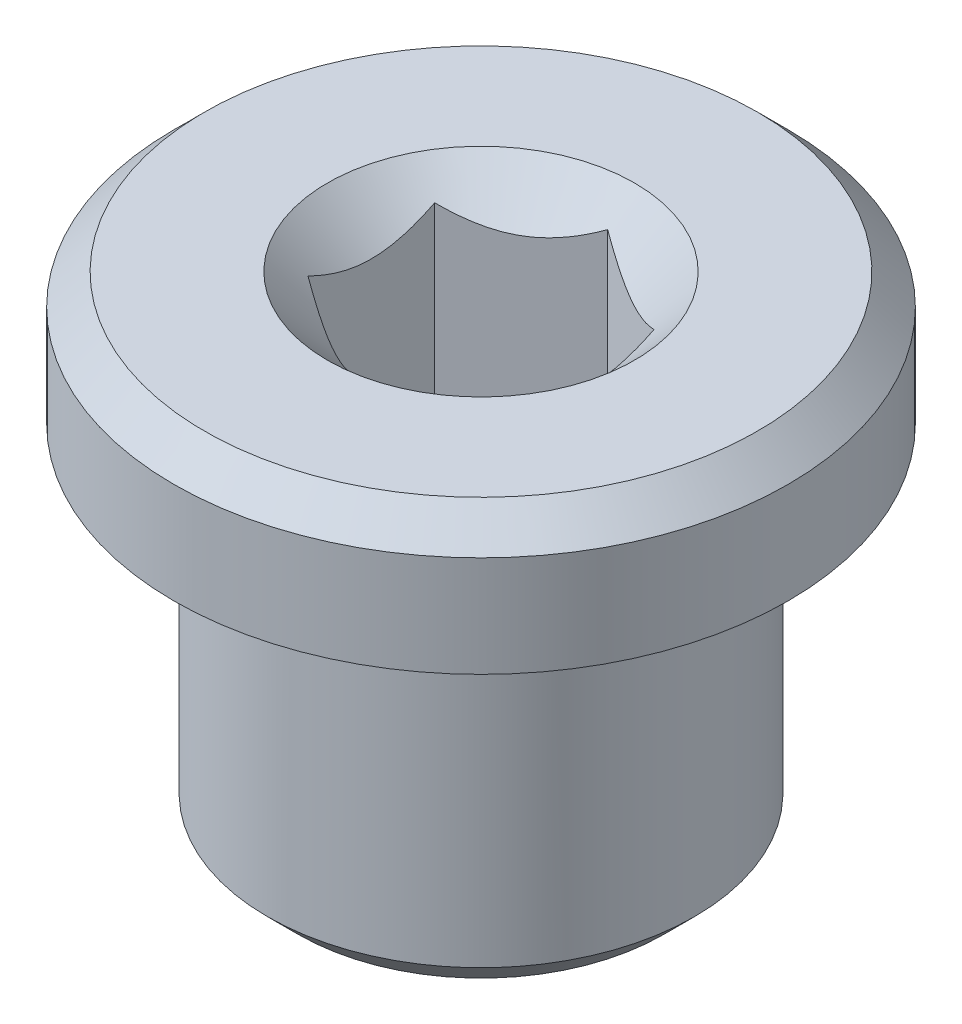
ISO-10303-21;
HEADER;
FILE_DESCRIPTION(('STEP AP214'),'2;1');
FILE_NAME('part.step','',(''),(''),'','','');
FILE_SCHEMA(('AUTOMOTIVE_DESIGN { 1 0 10303 214 1 1 1 1 }'));
ENDSEC;
DATA;
#1=APPLICATION_CONTEXT('core data for automotive mechanical design processes');
#2=APPLICATION_PROTOCOL_DEFINITION('international standard','automotive_design',2000,#1);
#3=PRODUCT_CONTEXT('',#1,'mechanical');
#4=PRODUCT('Part','Part','',(#3));
#5=PRODUCT_RELATED_PRODUCT_CATEGORY('part','',(#4));
#6=PRODUCT_DEFINITION_FORMATION('','',#4);
#7=PRODUCT_DEFINITION_CONTEXT('part definition',#1,'design');
#8=PRODUCT_DEFINITION('design','',#6,#7);
#9=PRODUCT_DEFINITION_SHAPE('','',#8);
#10=(LENGTH_UNIT() NAMED_UNIT(*) SI_UNIT(.MILLI.,.METRE.));
#11=(NAMED_UNIT(*) PLANE_ANGLE_UNIT() SI_UNIT($,.RADIAN.));
#12=(NAMED_UNIT(*) SI_UNIT($,.STERADIAN.) SOLID_ANGLE_UNIT());
#13=UNCERTAINTY_MEASURE_WITH_UNIT(LENGTH_MEASURE(1.E-05),#10,'distance_accuracy_value','');
#14=(GEOMETRIC_REPRESENTATION_CONTEXT(3) GLOBAL_UNCERTAINTY_ASSIGNED_CONTEXT((#13)) GLOBAL_UNIT_ASSIGNED_CONTEXT((#10,
#11,#12)) REPRESENTATION_CONTEXT('',''));
#15=CARTESIAN_POINT('',(0.,0.,0.));
#16=DIRECTION('',(0.,0.,1.));
#17=DIRECTION('',(1.,0.,0.));
#18=AXIS2_PLACEMENT_3D('',#15,#16,#17);
#19=CARTESIAN_POINT('',(0.,55.,-32.));
#20=DIRECTION('',(0.,1.,0.));
#21=DIRECTION('',(-1.,0.,0.));
#22=AXIS2_PLACEMENT_3D('',#19,#20,#21);
#23=PLANE('',#22);
#24=CARTESIAN_POINT('',(0.,55.0000000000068,-32.));
#25=DIRECTION('',(0.,1.,0.));
#26=DIRECTION('',(0.,0.,1.));
#27=AXIS2_PLACEMENT_3D('',#24,#25,#26);
#28=CIRCLE('',#27,3.50000000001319);
#29=CARTESIAN_POINT('',(0.,55.0000000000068,-28.4999999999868));
#30=VERTEX_POINT('',#29);
#31=EDGE_CURVE('E21',#30,#30,#28,.T.);
#32=ORIENTED_EDGE('',*,*,#31,.F.);
#33=EDGE_LOOP('',(#32));
#34=FACE_BOUND('',#33,.T.);
#35=CARTESIAN_POINT('',(0.,55.0000000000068,-32.));
#36=DIRECTION('',(0.,-1.,0.));
#37=DIRECTION('',(0.,0.,-1.));
#38=AXIS2_PLACEMENT_3D('',#35,#36,#37);
#39=CIRCLE('',#38,6.30000000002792);
#40=CARTESIAN_POINT('',(0.,55.0000000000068,-38.3000000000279));
#41=VERTEX_POINT('',#40);
#42=EDGE_CURVE('E189',#41,#41,#39,.T.);
#43=ORIENTED_EDGE('',*,*,#42,.F.);
#44=EDGE_LOOP('',(#43));
#45=FACE_BOUND('',#44,.T.);
#46=ADVANCED_FACE('F16',(#34,#45),#23,.T.);
#47=CARTESIAN_POINT('',(0.,54.300000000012,-32.));
#48=DIRECTION('',(0.,-1.,0.));
#49=DIRECTION('',(0.,0.,-1.));
#50=AXIS2_PLACEMENT_3D('',#47,#48,#49);
#51=CONICAL_SURFACE('',#50,6.99999999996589,0.785398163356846);
#52=ORIENTED_EDGE('',*,*,#42,.T.);
#53=EDGE_LOOP('',(#52));
#54=FACE_BOUND('',#53,.T.);
#55=CARTESIAN_POINT('',(0.,54.3,-32.));
#56=DIRECTION('',(0.,1.,0.));
#57=DIRECTION('',(-1.,0.,0.));
#58=AXIS2_PLACEMENT_3D('',#55,#56,#57);
#59=CIRCLE('',#58,7.);
#60=CARTESIAN_POINT('',(-7.,54.3,-32.));
#61=VERTEX_POINT('',#60);
#62=EDGE_CURVE('E184',#61,#61,#59,.F.);
#63=ORIENTED_EDGE('',*,*,#62,.F.);
#64=EDGE_LOOP('',(#63));
#65=FACE_BOUND('',#64,.T.);
#66=ADVANCED_FACE('F193',(#54,#65),#51,.T.);
#67=CARTESIAN_POINT('',(0.,55.,-32.));
#68=DIRECTION('',(0.,1.,0.));
#69=DIRECTION('',(-1.,0.,0.));
#70=AXIS2_PLACEMENT_3D('',#67,#68,#69);
#71=CYLINDRICAL_SURFACE('',#70,7.);
#72=CARTESIAN_POINT('',(0.,52.,-32.));
#73=DIRECTION('',(0.,1.,0.));
#74=DIRECTION('',(-1.,0.,0.));
#75=AXIS2_PLACEMENT_3D('',#72,#73,#74);
#76=CIRCLE('',#75,7.);
#77=CARTESIAN_POINT('',(-7.,52.,-32.));
#78=VERTEX_POINT('',#77);
#79=EDGE_CURVE('E181',#78,#78,#76,.T.);
#80=ORIENTED_EDGE('',*,*,#79,.T.);
#81=EDGE_LOOP('',(#80));
#82=FACE_BOUND('',#81,.T.);
#83=ORIENTED_EDGE('',*,*,#62,.T.);
#84=EDGE_LOOP('',(#83));
#85=FACE_BOUND('',#84,.T.);
#86=ADVANCED_FACE('F202',(#82,#85),#71,.T.);
#87=CARTESIAN_POINT('',(0.,52.,-32.));
#88=DIRECTION('',(0.,1.,0.));
#89=DIRECTION('',(-1.,0.,0.));
#90=AXIS2_PLACEMENT_3D('',#87,#88,#89);
#91=PLANE('',#90);
#92=CARTESIAN_POINT('',(0.,52.,-32.));
#93=DIRECTION('',(0.,-1.,0.));
#94=DIRECTION('',(1.,0.,0.));
#95=AXIS2_PLACEMENT_3D('',#92,#93,#94);
#96=CIRCLE('',#95,4.865);
#97=CARTESIAN_POINT('',(4.865,52.,-32.));
#98=VERTEX_POINT('',#97);
#99=EDGE_CURVE('E178',#98,#98,#96,.T.);
#100=ORIENTED_EDGE('',*,*,#99,.F.);
#101=EDGE_LOOP('',(#100));
#102=FACE_BOUND('',#101,.T.);
#103=ORIENTED_EDGE('',*,*,#79,.F.);
#104=EDGE_LOOP('',(#103));
#105=FACE_BOUND('',#104,.T.);
#106=ADVANCED_FACE('F207',(#102,#105),#91,.F.);
#107=CARTESIAN_POINT('',(0.,44.,-32.));
#108=DIRECTION('',(0.,1.,0.));
#109=DIRECTION('',(-1.,0.,0.));
#110=AXIS2_PLACEMENT_3D('',#107,#108,#109);
#111=PLANE('',#110);
#112=CARTESIAN_POINT('',(0.,43.9999999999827,-32.));
#113=DIRECTION('',(0.,1.,0.));
#114=DIRECTION('',(0.,0.,1.));
#115=AXIS2_PLACEMENT_3D('',#112,#113,#114);
#116=CIRCLE('',#115,4.16499999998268);
#117=CARTESIAN_POINT('',(0.,43.9999999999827,-27.8350000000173));
#118=VERTEX_POINT('',#117);
#119=EDGE_CURVE('E175',#118,#118,#116,.T.);
#120=ORIENTED_EDGE('',*,*,#119,.F.);
#121=EDGE_LOOP('',(#120));
#122=FACE_BOUND('',#121,.T.);
#123=ADVANCED_FACE('F211',(#122),#111,.F.);
#124=CARTESIAN_POINT('',(0.,44.6999999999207,-32.));
#125=DIRECTION('',(0.,1.,0.));
#126=DIRECTION('',(0.,0.,1.));
#127=AXIS2_PLACEMENT_3D('',#124,#125,#126);
#128=CONICAL_SURFACE('',#127,4.86499999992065,0.785398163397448);
#129=CARTESIAN_POINT('',(0.,44.7,-32.));
#130=DIRECTION('',(0.,-1.,0.));
#131=DIRECTION('',(1.,0.,0.));
#132=AXIS2_PLACEMENT_3D('',#129,#130,#131);
#133=CIRCLE('',#132,4.865);
#134=CARTESIAN_POINT('',(4.865,44.7,-32.));
#135=VERTEX_POINT('',#134);
#136=EDGE_CURVE('E170',#135,#135,#133,.F.);
#137=ORIENTED_EDGE('',*,*,#136,.F.);
#138=EDGE_LOOP('',(#137));
#139=FACE_BOUND('',#138,.T.);
#140=ORIENTED_EDGE('',*,*,#119,.T.);
#141=EDGE_LOOP('',(#140));
#142=FACE_BOUND('',#141,.T.);
#143=ADVANCED_FACE('F215',(#139,#142),#128,.T.);
#144=CARTESIAN_POINT('',(0.,44.,-32.));
#145=DIRECTION('',(0.,-1.,0.));
#146=DIRECTION('',(1.,0.,0.));
#147=AXIS2_PLACEMENT_3D('',#144,#145,#146);
#148=CYLINDRICAL_SURFACE('',#147,4.865);
#149=ORIENTED_EDGE('',*,*,#136,.T.);
#150=EDGE_LOOP('',(#149));
#151=FACE_BOUND('',#150,.T.);
#152=ORIENTED_EDGE('',*,*,#99,.T.);
#153=EDGE_LOOP('',(#152));
#154=FACE_BOUND('',#153,.T.);
#155=ADVANCED_FACE('F218',(#151,#154),#148,.T.);
#156=CARTESIAN_POINT('',(-2.5,50.,-30.5566243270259));
#157=DIRECTION('',(-0.5,0.,0.866025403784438));
#158=DIRECTION('',(0.866025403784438,0.,0.5));
#159=AXIS2_PLACEMENT_3D('',#156,#157,#158);
#160=PLANE('',#159);
#161=DIRECTION('',(0.,1.,0.));
#162=VECTOR('',#161,1.);
#163=CARTESIAN_POINT('',(0.,50.,-29.1132486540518));
#164=LINE('',#163,#162);
#165=CARTESIAN_POINT('',(0.,50.,-29.1132486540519));
#166=VERTEX_POINT('',#165);
#167=CARTESIAN_POINT('',(2.93779550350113E-09,54.3867513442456,-29.113248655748));
#168=VERTEX_POINT('',#167);
#169=EDGE_CURVE('E168',#166,#168,#164,.T.);
#170=ORIENTED_EDGE('',*,*,#169,.F.);
#171=DIRECTION('',(0.866025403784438,0.,0.5));
#172=VECTOR('',#171,1.);
#173=CARTESIAN_POINT('',(-2.5,50.,-30.5566243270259));
#174=LINE('',#173,#172);
#175=CARTESIAN_POINT('',(-2.5,50.,-30.5566243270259));
#176=VERTEX_POINT('',#175);
#177=EDGE_CURVE('E164',#176,#166,#174,.T.);
#178=ORIENTED_EDGE('',*,*,#177,.F.);
#179=DIRECTION('',(0.,1.,0.));
#180=VECTOR('',#179,1.);
#181=CARTESIAN_POINT('',(-2.5,50.,-30.5566243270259));
#182=LINE('',#181,#180);
#183=CARTESIAN_POINT('',(-2.50000002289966,54.3867513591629,-30.556624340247));
#184=VERTEX_POINT('',#183);
#185=EDGE_CURVE('E163',#184,#176,#182,.F.);
#186=ORIENTED_EDGE('',*,*,#185,.F.);
#187=CARTESIAN_POINT('',(-2.50000004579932,54.386751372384,-30.5566243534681));
#188=CARTESIAN_POINT('',(-2.41407382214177,54.3371894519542,-30.507014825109));
#189=CARTESIAN_POINT('',(-2.32671091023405,54.2905388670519,-30.4565758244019));
#190=CARTESIAN_POINT('',(-2.14856896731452,54.2051236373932,-30.3537255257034));
#191=CARTESIAN_POINT('',(-2.05777300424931,54.1664065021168,-30.3013044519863));
#192=CARTESIAN_POINT('',(-1.87468739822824,54.1000837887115,-30.1955999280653));
#193=CARTESIAN_POINT('',(-1.7824443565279,54.0723115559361,-30.1423433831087));
#194=CARTESIAN_POINT('',(-1.59592810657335,54.0295231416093,-30.0346581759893));
#195=CARTESIAN_POINT('',(-1.50166059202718,54.0144750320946,-29.9802328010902));
#196=CARTESIAN_POINT('',(-1.33918619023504,54.0008973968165,-29.8864281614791));
#197=CARTESIAN_POINT('',(-1.27118905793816,53.9988880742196,-29.8471699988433));
#198=CARTESIAN_POINT('',(-1.13530604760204,54.00227754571,-29.7687179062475));
#199=CARTESIAN_POINT('',(-1.067420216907,54.0076789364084,-29.7295240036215));
#200=CARTESIAN_POINT('',(-0.932289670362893,54.0255824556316,-29.6515063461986));
#201=CARTESIAN_POINT('',(-0.865045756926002,54.0380925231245,-29.6126830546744));
#202=CARTESIAN_POINT('',(-0.731720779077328,54.069526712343,-29.5357078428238));
#203=CARTESIAN_POINT('',(-0.665639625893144,54.0884503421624,-29.4975558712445));
#204=CARTESIAN_POINT('',(-0.496416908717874,54.144615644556,-29.3998550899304));
#205=CARTESIAN_POINT('',(-0.394323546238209,54.1860863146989,-29.3409114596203));
#206=CARTESIAN_POINT('',(-0.244203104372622,54.2560924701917,-29.2542393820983));
#207=CARTESIAN_POINT('',(-0.194731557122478,54.2806890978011,-29.2256769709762));
#208=CARTESIAN_POINT('',(-0.0967044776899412,54.3321241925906,-29.169081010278));
#209=CARTESIAN_POINT('',(-0.04814840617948,54.3589612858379,-29.1410471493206));
#210=CARTESIAN_POINT('',(-8.92368186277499E-09,54.3867513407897,-29.1132486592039));
#211=B_SPLINE_CURVE_WITH_KNOTS('',3,(#187,#188,#189,#190,#191,#192,#193,#194,#195,#196,#197,
#198,#199,#200,#201,#202,#203,#204,#205,#206,#207,#208,#209,#210),.UNSPECIFIED.,.F.,.F.,(4,2,2,
2,2,2,2,2,2,2,2,4),(0.,0.332957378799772,0.667853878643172,0.997433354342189,1.32618335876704,
1.56147595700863,1.79685101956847,2.03248946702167,2.26810984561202,2.64223187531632,
2.8287854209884,3.01522539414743),.UNSPECIFIED.);
#212=EDGE_CURVE('E39',#184,#168,#211,.T.);
#213=ORIENTED_EDGE('',*,*,#212,.T.);
#214=EDGE_LOOP('',(#170,#178,#186,#213));
#215=FACE_BOUND('',#214,.T.);
#216=ADVANCED_FACE('F152',(#215),#160,.F.);
#217=CARTESIAN_POINT('',(-2.5,50.,-33.4433756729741));
#218=DIRECTION('',(-1.,0.,0.));
#219=DIRECTION('',(0.,0.,1.));
#220=AXIS2_PLACEMENT_3D('',#217,#218,#219);
#221=PLANE('',#220);
#222=ORIENTED_EDGE('',*,*,#185,.T.);
#223=DIRECTION('',(0.,0.,1.));
#224=VECTOR('',#223,1.);
#225=CARTESIAN_POINT('',(-2.5,50.,-33.4433756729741));
#226=LINE('',#225,#224);
#227=CARTESIAN_POINT('',(-2.49999999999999,50.,-33.4433756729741));
#228=VERTEX_POINT('',#227);
#229=EDGE_CURVE('E124',#228,#176,#226,.T.);
#230=ORIENTED_EDGE('',*,*,#229,.F.);
#231=DIRECTION('',(0.,1.,0.));
#232=VECTOR('',#231,1.);
#233=CARTESIAN_POINT('',(-2.5,50.,-33.4433756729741));
#234=LINE('',#233,#232);
#235=CARTESIAN_POINT('',(-2.5,54.3867513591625,-33.4433756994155));
#236=VERTEX_POINT('',#235);
#237=EDGE_CURVE('E129',#236,#228,#234,.F.);
#238=ORIENTED_EDGE('',*,*,#237,.F.);
#239=CARTESIAN_POINT('',(-2.5,54.3867513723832,-33.4433757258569));
#240=CARTESIAN_POINT('',(-2.5,54.3371894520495,-33.3441566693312));
#241=CARTESIAN_POINT('',(-2.5,54.2905388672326,-33.2432786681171));
#242=CARTESIAN_POINT('',(-2.5,54.2051236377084,-33.0375780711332));
#243=CARTESIAN_POINT('',(-2.5,54.1664065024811,-32.9327359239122));
#244=CARTESIAN_POINT('',(-2.5,54.100083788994,-32.7213268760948));
#245=CARTESIAN_POINT('',(-2.5,54.0723115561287,-32.6148137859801));
#246=CARTESIAN_POINT('',(-2.5,54.0295231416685,-32.3994433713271));
#247=CARTESIAN_POINT('',(-2.5,54.0144750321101,-32.2905926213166));
#248=CARTESIAN_POINT('',(-2.5,54.0008973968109,-32.1029833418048));
#249=CARTESIAN_POINT('',(-2.5,53.9988880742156,-32.0244670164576));
#250=CARTESIAN_POINT('',(-2.5,54.0022775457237,-31.867562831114));
#251=CARTESIAN_POINT('',(-2.5,54.0076789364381,-31.7891750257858));
#252=CARTESIAN_POINT('',(-2.5,54.0255824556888,-31.6331397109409));
#253=CARTESIAN_POINT('',(-2.5,54.0380925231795,-31.5554931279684));
#254=CARTESIAN_POINT('',(-2.5,54.0695267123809,-31.4015427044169));
#255=CARTESIAN_POINT('',(-2.5,54.088450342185,-31.3252387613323));
#256=CARTESIAN_POINT('',(-2.5,54.1446156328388,-31.1298372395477));
#257=CARTESIAN_POINT('',(-2.5,54.1860862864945,-31.0119500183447));
#258=CARTESIAN_POINT('',(-2.5,54.2560924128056,-30.8386059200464));
#259=CARTESIAN_POINT('',(-2.5,54.2806890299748,-30.7814811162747));
#260=CARTESIAN_POINT('',(-2.5,54.3321241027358,-30.6682892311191));
#261=CARTESIAN_POINT('',(-2.5,54.3589611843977,-30.6122215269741));
#262=CARTESIAN_POINT('',(-2.5,54.3867512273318,-30.5566245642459));
#263=B_SPLINE_CURVE_WITH_KNOTS('',3,(#239,#240,#241,#242,#243,#244,#245,#246,#247,#248,#249,
#250,#251,#252,#253,#254,#255,#256,#257,#258,#259,#260,#261,#262),.UNSPECIFIED.,.F.,.F.,(4,2,2,
2,2,2,2,2,2,2,2,4),(0.,0.332957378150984,0.66785387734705,0.997433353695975,1.32618335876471,
1.56147595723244,1.79685102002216,2.03248946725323,2.26810984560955,2.64223174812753,
2.82878523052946,3.01522514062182),.UNSPECIFIED.);
#264=EDGE_CURVE('E10',#236,#184,#263,.T.);
#265=ORIENTED_EDGE('',*,*,#264,.T.);
#266=EDGE_LOOP('',(#222,#230,#238,#265));
#267=FACE_BOUND('',#266,.T.);
#268=ADVANCED_FACE('F147',(#267),#221,.F.);
#269=CARTESIAN_POINT('',(0.,50.,-34.8867513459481));
#270=DIRECTION('',(-0.5,0.,-0.866025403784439));
#271=DIRECTION('',(-0.866025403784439,0.,0.5));
#272=AXIS2_PLACEMENT_3D('',#269,#270,#271);
#273=PLANE('',#272);
#274=ORIENTED_EDGE('',*,*,#237,.T.);
#275=DIRECTION('',(-0.866025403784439,0.,0.5));
#276=VECTOR('',#275,1.);
#277=CARTESIAN_POINT('',(0.,50.,-34.8867513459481));
#278=LINE('',#277,#276);
#279=CARTESIAN_POINT('',(0.,50.,-34.8867513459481));
#280=VERTEX_POINT('',#279);
#281=EDGE_CURVE('E120',#280,#228,#278,.T.);
#282=ORIENTED_EDGE('',*,*,#281,.F.);
#283=DIRECTION('',(0.,1.,0.));
#284=VECTOR('',#283,1.);
#285=CARTESIAN_POINT('',(0.,50.,-34.8867513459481));
#286=LINE('',#285,#284);
#287=CARTESIAN_POINT('',(2.28991515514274E-08,54.3867513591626,-34.8867513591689));
#288=VERTEX_POINT('',#287);
#289=EDGE_CURVE('E128',#288,#280,#286,.F.);
#290=ORIENTED_EDGE('',*,*,#289,.F.);
#291=CARTESIAN_POINT('',(4.5798304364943E-08,54.3867513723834,-34.8867513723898));
#292=CARTESIAN_POINT('',(-0.0859261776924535,54.3371894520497,-34.8371418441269));
#293=CARTESIAN_POINT('',(-0.173289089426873,54.2905388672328,-34.7867028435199));
#294=CARTESIAN_POINT('',(-0.351431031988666,54.2051236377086,-34.6838525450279));
#295=CARTESIAN_POINT('',(-0.442226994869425,54.1664065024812,-34.6314314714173));
#296=CARTESIAN_POINT('',(-0.625312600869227,54.100083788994,-34.5257269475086));
#297=CARTESIAN_POINT('',(-0.717555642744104,54.0723115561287,-34.4724704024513));
#298=CARTESIAN_POINT('',(-0.904071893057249,54.0295231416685,-34.3647851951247));
#299=CARTESIAN_POINT('',(-0.998339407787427,54.0144750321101,-34.3103598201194));
#300=CARTESIAN_POINT('',(-1.16081380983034,54.0008973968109,-34.2165551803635));
#301=CARTESIAN_POINT('',(-1.22881094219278,53.9988880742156,-34.1772970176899));
#302=CARTESIAN_POINT('',(-1.36469395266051,54.0022775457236,-34.0988449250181));
#303=CARTESIAN_POINT('',(-1.4325797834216,54.0076789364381,-34.059651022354));
#304=CARTESIAN_POINT('',(-1.56771032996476,54.0255824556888,-33.9816333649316));
#305=CARTESIAN_POINT('',(-1.63495424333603,54.0380925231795,-33.9428100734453));
#306=CARTESIAN_POINT('',(-1.76827922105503,54.0695267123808,-33.8658348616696));
#307=CARTESIAN_POINT('',(-1.83436037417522,54.0884503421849,-33.8276828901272));
#308=CARTESIAN_POINT('',(-2.00358305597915,54.1446156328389,-33.7299821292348));
#309=CARTESIAN_POINT('',(-2.10567638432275,54.1860862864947,-33.6710385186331));
#310=CARTESIAN_POINT('',(-2.25579677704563,54.256092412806,-33.5843664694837));
#311=CARTESIAN_POINT('',(-2.30526830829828,54.2806890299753,-33.5558040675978));
#312=CARTESIAN_POINT('',(-2.40329535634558,54.3321241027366,-33.4992081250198));
#313=CARTESIAN_POINT('',(-2.45185141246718,54.3589611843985,-33.4711742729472));
#314=CARTESIAN_POINT('',(-2.49999979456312,54.3867512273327,-33.4433757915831));
#315=B_SPLINE_CURVE_WITH_KNOTS('',3,(#291,#292,#293,#294,#295,#296,#297,#298,#299,#300,#301,
#302,#303,#304,#305,#306,#307,#308,#309,#310,#311,#312,#313,#314),.UNSPECIFIED.,.F.,.F.,(4,2,2,
2,2,2,2,2,2,2,2,4),(0.,0.332957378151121,0.667853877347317,0.997433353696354,1.32618335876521,
1.56147595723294,1.79685102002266,2.03248946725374,2.26810984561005,2.64223174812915,
2.82878523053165,3.01522514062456),.UNSPECIFIED.);
#316=EDGE_CURVE('E26',#288,#236,#315,.T.);
#317=ORIENTED_EDGE('',*,*,#316,.T.);
#318=EDGE_LOOP('',(#274,#282,#290,#317));
#319=FACE_BOUND('',#318,.T.);
#320=ADVANCED_FACE('F151',(#319),#273,.F.);
#321=CARTESIAN_POINT('',(2.49999999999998,50.,-33.4433756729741));
#322=DIRECTION('',(0.5,0.,-0.866025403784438));
#323=DIRECTION('',(-0.866025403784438,0.,-0.5));
#324=AXIS2_PLACEMENT_3D('',#321,#322,#323);
#325=PLANE('',#324);
#326=ORIENTED_EDGE('',*,*,#289,.T.);
#327=DIRECTION('',(-0.866025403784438,0.,-0.5));
#328=VECTOR('',#327,1.);
#329=CARTESIAN_POINT('',(2.49999999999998,50.,-33.4433756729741));
#330=LINE('',#329,#328);
#331=CARTESIAN_POINT('',(2.5,50.,-33.4433756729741));
#332=VERTEX_POINT('',#331);
#333=EDGE_CURVE('E82',#332,#280,#330,.T.);
#334=ORIENTED_EDGE('',*,*,#333,.F.);
#335=DIRECTION('',(0.,1.,0.));
#336=VECTOR('',#335,1.);
#337=CARTESIAN_POINT('',(2.49999999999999,50.,-33.4433756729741));
#338=LINE('',#337,#336);
#339=CARTESIAN_POINT('',(2.50000002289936,54.3867513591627,-33.4433756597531));
#340=VERTEX_POINT('',#339);
#341=EDGE_CURVE('E79',#340,#332,#338,.F.);
#342=ORIENTED_EDGE('',*,*,#341,.F.);
#343=CARTESIAN_POINT('',(2.50000004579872,54.3867513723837,-33.4433756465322));
#344=CARTESIAN_POINT('',(2.41407382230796,54.33718945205,-33.492985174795));
#345=CARTESIAN_POINT('',(2.32671091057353,54.290538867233,-33.5434241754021));
#346=CARTESIAN_POINT('',(2.14856896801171,54.2051236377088,-33.6462744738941));
#347=CARTESIAN_POINT('',(2.05777300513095,54.1664065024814,-33.6986955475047));
#348=CARTESIAN_POINT('',(1.87468739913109,54.1000837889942,-33.8044000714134));
#349=CARTESIAN_POINT('',(1.78244435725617,54.0723115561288,-33.8576566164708));
#350=CARTESIAN_POINT('',(1.59592810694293,54.0295231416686,-33.9653418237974));
#351=CARTESIAN_POINT('',(1.5016605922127,54.0144750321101,-34.0197671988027));
#352=CARTESIAN_POINT('',(1.33918619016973,54.0008973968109,-34.1135718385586));
#353=CARTESIAN_POINT('',(1.27118905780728,53.9988880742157,-34.1528300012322));
#354=CARTESIAN_POINT('',(1.13530604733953,54.0022775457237,-34.2312820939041));
#355=CARTESIAN_POINT('',(1.06742021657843,54.0076789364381,-34.2704759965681));
#356=CARTESIAN_POINT('',(0.932289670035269,54.0255824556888,-34.3484936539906));
#357=CARTESIAN_POINT('',(0.865045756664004,54.0380925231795,-34.3873169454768));
#358=CARTESIAN_POINT('',(0.731720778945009,54.0695267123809,-34.4642921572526));
#359=CARTESIAN_POINT('',(0.665639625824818,54.088450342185,-34.5024441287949));
#360=CARTESIAN_POINT('',(0.496416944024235,54.1446156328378,-34.6001448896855));
#361=CARTESIAN_POINT('',(0.394323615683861,54.1860862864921,-34.6590885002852));
#362=CARTESIAN_POINT('',(0.244203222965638,54.2560924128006,-34.745760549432));
#363=CARTESIAN_POINT('',(0.194731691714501,54.2806890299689,-34.774322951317));
#364=CARTESIAN_POINT('',(0.096704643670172,54.3321241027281,-34.8309188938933));
#365=CARTESIAN_POINT('',(0.0481485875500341,54.358961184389,-34.858952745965));
#366=CARTESIAN_POINT('',(2.05455523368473E-07,54.386751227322,-34.8867512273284));
#367=B_SPLINE_CURVE_WITH_KNOTS('',3,(#343,#344,#345,#346,#347,#348,#349,#350,#351,#352,#353,
#354,#355,#356,#357,#358,#359,#360,#361,#362,#363,#364,#365,#366),.UNSPECIFIED.,.F.,.F.,(4,2,2,
2,2,2,2,2,2,2,2,4),(0.,0.332957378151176,0.667853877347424,0.997433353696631,1.32618335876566,
1.56147595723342,1.79685102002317,2.03248946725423,2.26810984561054,2.6422317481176,
2.8287852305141,3.01522514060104),.UNSPECIFIED.);
#368=EDGE_CURVE('E70',#340,#288,#367,.T.);
#369=ORIENTED_EDGE('',*,*,#368,.T.);
#370=EDGE_LOOP('',(#326,#334,#342,#369));
#371=FACE_BOUND('',#370,.T.);
#372=ADVANCED_FACE('F80',(#371),#325,.F.);
#373=CARTESIAN_POINT('',(2.5,50.,-30.5566243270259));
#374=DIRECTION('',(1.,0.,0.));
#375=DIRECTION('',(0.,0.,-1.));
#376=AXIS2_PLACEMENT_3D('',#373,#374,#375);
#377=PLANE('',#376);
#378=ORIENTED_EDGE('',*,*,#341,.T.);
#379=DIRECTION('',(0.,0.,-1.));
#380=VECTOR('',#379,1.);
#381=CARTESIAN_POINT('',(2.5,50.,-30.5566243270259));
#382=LINE('',#381,#380);
#383=CARTESIAN_POINT('',(2.49999999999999,50.,-30.5566243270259));
#384=VERTEX_POINT('',#383);
#385=EDGE_CURVE('E60',#384,#332,#382,.T.);
#386=ORIENTED_EDGE('',*,*,#385,.F.);
#387=DIRECTION('',(0.,1.,0.));
#388=VECTOR('',#387,1.);
#389=CARTESIAN_POINT('',(2.5,50.,-30.5566243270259));
#390=LINE('',#389,#388);
#391=CARTESIAN_POINT('',(2.5,54.3867513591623,-30.5566243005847));
#392=VERTEX_POINT('',#391);
#393=EDGE_CURVE('E85',#392,#384,#390,.F.);
#394=ORIENTED_EDGE('',*,*,#393,.F.);
#395=CARTESIAN_POINT('',(2.5,54.3867513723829,-30.5566242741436));
#396=CARTESIAN_POINT('',(2.5,54.3371894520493,-30.6558433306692));
#397=CARTESIAN_POINT('',(2.5,54.2905388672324,-30.7567213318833));
#398=CARTESIAN_POINT('',(2.5,54.2051236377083,-30.9624219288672));
#399=CARTESIAN_POINT('',(2.5,54.166406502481,-31.0672640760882));
#400=CARTESIAN_POINT('',(2.5,54.1000837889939,-31.2786731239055));
#401=CARTESIAN_POINT('',(2.5,54.0723115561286,-31.3851862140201));
#402=CARTESIAN_POINT('',(2.5,54.0295231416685,-31.600556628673));
#403=CARTESIAN_POINT('',(2.5,54.0144750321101,-31.7094073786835));
#404=CARTESIAN_POINT('',(2.5,54.0008973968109,-31.8970166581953));
#405=CARTESIAN_POINT('',(2.5,53.9988880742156,-31.9755329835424));
#406=CARTESIAN_POINT('',(2.5,54.0022775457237,-32.1324371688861));
#407=CARTESIAN_POINT('',(2.5,54.0076789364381,-32.2108249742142));
#408=CARTESIAN_POINT('',(2.5,54.0255824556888,-32.3668602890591));
#409=CARTESIAN_POINT('',(2.5,54.0380925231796,-32.4445068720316));
#410=CARTESIAN_POINT('',(2.5,54.0695267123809,-32.5984572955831));
#411=CARTESIAN_POINT('',(2.5,54.088450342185,-32.6747612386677));
#412=CARTESIAN_POINT('',(2.5,54.1446156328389,-32.8701627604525));
#413=CARTESIAN_POINT('',(2.5,54.1860862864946,-32.9880499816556));
#414=CARTESIAN_POINT('',(2.5,54.2560924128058,-33.1613940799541));
#415=CARTESIAN_POINT('',(2.5,54.280689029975,-33.2185188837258));
#416=CARTESIAN_POINT('',(2.5,54.3321241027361,-33.3317107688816));
#417=CARTESIAN_POINT('',(2.5,54.358961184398,-33.3877784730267));
#418=CARTESIAN_POINT('',(2.5,54.3867512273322,-33.4433754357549));
#419=B_SPLINE_CURVE_WITH_KNOTS('',3,(#395,#396,#397,#398,#399,#400,#401,#402,#403,#404,#405,
#406,#407,#408,#409,#410,#411,#412,#413,#414,#415,#416,#417,#418),.UNSPECIFIED.,.F.,.F.,(4,2,2,
2,2,2,2,2,2,2,2,4),(0.,0.332957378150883,0.66785387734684,0.997433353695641,1.32618335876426,
1.56147595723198,1.79685102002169,2.03248946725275,2.26810984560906,2.64223174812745,
2.8287852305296,3.01522514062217),.UNSPECIFIED.);
#420=EDGE_CURVE('E73',#392,#340,#419,.T.);
#421=ORIENTED_EDGE('',*,*,#420,.T.);
#422=EDGE_LOOP('',(#378,#386,#394,#421));
#423=FACE_BOUND('',#422,.T.);
#424=ADVANCED_FACE('F84',(#423),#377,.F.);
#425=CARTESIAN_POINT('',(0.,50.,-29.1132486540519));
#426=DIRECTION('',(0.5,0.,0.866025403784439));
#427=DIRECTION('',(0.866025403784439,0.,-0.5));
#428=AXIS2_PLACEMENT_3D('',#425,#426,#427);
#429=PLANE('',#428);
#430=ORIENTED_EDGE('',*,*,#393,.T.);
#431=DIRECTION('',(0.866025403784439,0.,-0.5));
#432=VECTOR('',#431,1.);
#433=CARTESIAN_POINT('',(0.,50.,-29.1132486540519));
#434=LINE('',#433,#432);
#435=EDGE_CURVE('E138',#166,#384,#434,.T.);
#436=ORIENTED_EDGE('',*,*,#435,.F.);
#437=ORIENTED_EDGE('',*,*,#169,.T.);
#438=CARTESIAN_POINT('',(5.0119463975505E-09,54.3867513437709,-29.1132486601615));
#439=CARTESIAN_POINT('',(0.0859262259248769,54.3371894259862,-29.1628581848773));
#440=CARTESIAN_POINT('',(0.173289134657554,54.2905388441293,-29.2132971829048));
#441=CARTESIAN_POINT('',(0.351431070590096,54.2051236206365,-29.3161474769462));
#442=CARTESIAN_POINT('',(0.44222702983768,54.1664064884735,-29.3685685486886));
#443=CARTESIAN_POINT('',(0.62531262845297,54.1000837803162,-29.4742730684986));
#444=CARTESIAN_POINT('',(0.717555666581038,54.0723115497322,-29.5275296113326));
#445=CARTESIAN_POINT('',(0.904071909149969,54.0295231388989,-29.6352148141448));
#446=CARTESIAN_POINT('',(0.998339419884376,54.0144750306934,-29.6896401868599));
#447=CARTESIAN_POINT('',(1.16081381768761,54.0008973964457,-29.7834448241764));
#448=CARTESIAN_POINT('',(1.22881094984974,53.9988880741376,-29.8227029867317));
#449=CARTESIAN_POINT('',(1.36469395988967,54.0022775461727,-29.9011550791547));
#450=CARTESIAN_POINT('',(1.43257979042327,54.0076789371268,-29.9403489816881));
#451=CARTESIAN_POINT('',(1.5677103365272,54.0255824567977,-30.0183666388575));
#452=CARTESIAN_POINT('',(1.63495424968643,54.0380925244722,-30.0571899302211));
#453=CARTESIAN_POINT('',(1.76827922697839,54.0695267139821,-30.1341651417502));
#454=CARTESIAN_POINT('',(1.83436037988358,54.0884503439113,-30.1723171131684));
#455=CARTESIAN_POINT('',(2.00358306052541,54.1446156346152,-30.2700178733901));
#456=CARTESIAN_POINT('',(2.10567638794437,54.1860862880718,-30.3289614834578));
#457=CARTESIAN_POINT('',(2.25579677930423,54.2560924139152,-30.4156335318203));
#458=CARTESIAN_POINT('',(2.30526831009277,54.2806890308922,-30.4441959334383));
#459=CARTESIAN_POINT('',(2.40329535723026,54.3321241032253,-30.500791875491));
#460=CARTESIAN_POINT('',(2.45185141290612,54.3589611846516,-30.5288257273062));
#461=CARTESIAN_POINT('',(2.49999979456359,54.386751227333,-30.5566242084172));
#462=B_SPLINE_CURVE_WITH_KNOTS('',3,(#438,#439,#440,#441,#442,#443,#444,#445,#446,#447,#448,
#449,#450,#451,#452,#453,#454,#455,#456,#457,#458,#459,#460,#461),.UNSPECIFIED.,.F.,.F.,(4,2,2,
2,2,2,2,2,2,2,2,4),(0.,0.332957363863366,0.667853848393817,0.997433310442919,1.32618330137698,
1.56147589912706,1.79685096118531,2.03248940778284,2.26810978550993,2.64223168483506,
2.8287851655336,3.01522507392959),.UNSPECIFIED.);
#463=EDGE_CURVE('E50',#168,#392,#462,.T.);
#464=ORIENTED_EDGE('',*,*,#463,.T.);
#465=EDGE_LOOP('',(#430,#436,#437,#464));
#466=FACE_BOUND('',#465,.T.);
#467=ADVANCED_FACE('F103',(#466),#429,.F.);
#468=CARTESIAN_POINT('',(0.,50.,-29.1132486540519));
#469=DIRECTION('',(0.,1.,0.));
#470=DIRECTION('',(-1.,0.,0.));
#471=AXIS2_PLACEMENT_3D('',#468,#469,#470);
#472=PLANE('',#471);
#473=ORIENTED_EDGE('',*,*,#281,.T.);
#474=ORIENTED_EDGE('',*,*,#229,.T.);
#475=ORIENTED_EDGE('',*,*,#177,.T.);
#476=ORIENTED_EDGE('',*,*,#435,.T.);
#477=ORIENTED_EDGE('',*,*,#385,.T.);
#478=ORIENTED_EDGE('',*,*,#333,.T.);
#479=EDGE_LOOP('',(#473,#474,#475,#476,#477,#478));
#480=FACE_BOUND('',#479,.T.);
#481=ADVANCED_FACE('F108',(#480),#472,.T.);
#482=CARTESIAN_POINT('',(0.,54.99999999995,-32.));
#483=DIRECTION('',(0.,1.,0.));
#484=DIRECTION('',(0.,0.,1.));
#485=AXIS2_PLACEMENT_3D('',#482,#483,#484);
#486=CONICAL_SURFACE('',#485,3.49999999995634,0.785398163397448);
#487=ORIENTED_EDGE('',*,*,#31,.T.);
#488=EDGE_LOOP('',(#487));
#489=FACE_BOUND('',#488,.T.);
#490=ORIENTED_EDGE('',*,*,#212,.F.);
#491=ORIENTED_EDGE('',*,*,#264,.F.);
#492=ORIENTED_EDGE('',*,*,#316,.F.);
#493=ORIENTED_EDGE('',*,*,#368,.F.);
#494=ORIENTED_EDGE('',*,*,#420,.F.);
#495=ORIENTED_EDGE('',*,*,#463,.F.);
#496=EDGE_LOOP('',(#490,#491,#492,#493,#494,#495));
#497=FACE_BOUND('',#496,.T.);
#498=ADVANCED_FACE('F18',(#489,#497),#486,.F.);
#499=CLOSED_SHELL('',(#46,#66,#86,#106,#123,#143,#155,#216,#268,#320,#372,#424,#467,#481,#498));
#500=MANIFOLD_SOLID_BREP('B1',#499);
#501=ADVANCED_BREP_SHAPE_REPRESENTATION('',(#18,#500),#14);
#502=SHAPE_DEFINITION_REPRESENTATION(#9,#501);
ENDSEC;
END-ISO-10303-21;
